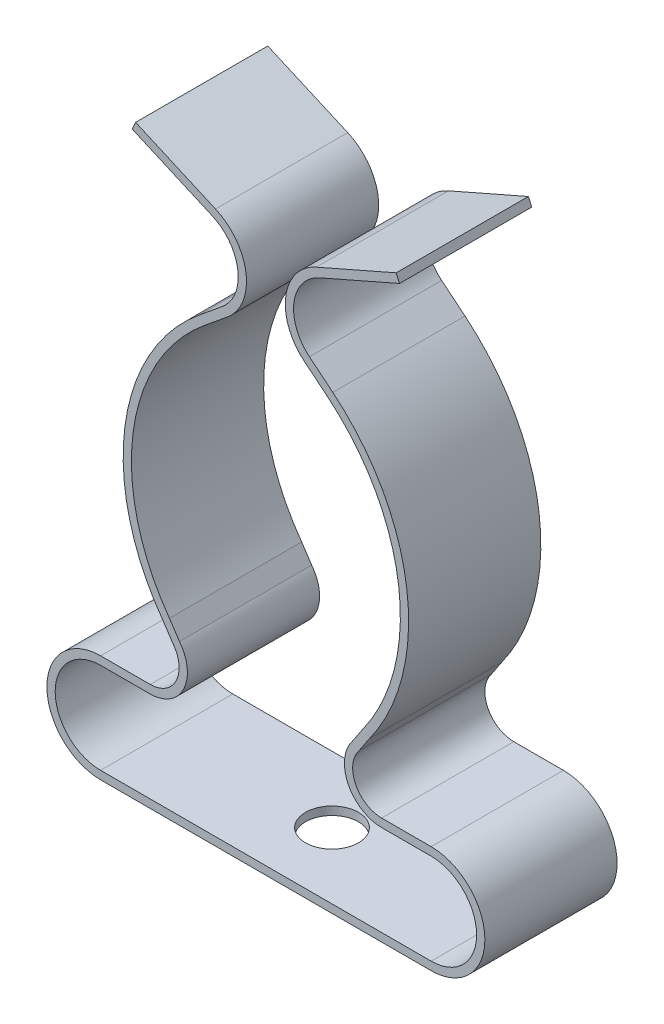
ISO-10303-21;
HEADER;
FILE_DESCRIPTION(('STEP AP214'),'2;1');
FILE_NAME('part.step','',(''),(''),'','','');
FILE_SCHEMA(('AUTOMOTIVE_DESIGN { 1 0 10303 214 1 1 1 1 }'));
ENDSEC;
DATA;
#1=APPLICATION_CONTEXT('core data for automotive mechanical design processes');
#2=APPLICATION_PROTOCOL_DEFINITION('international standard','automotive_design',2000,#1);
#3=PRODUCT_CONTEXT('',#1,'mechanical');
#4=PRODUCT('Part','Part','',(#3));
#5=PRODUCT_RELATED_PRODUCT_CATEGORY('part','',(#4));
#6=PRODUCT_DEFINITION_FORMATION('','',#4);
#7=PRODUCT_DEFINITION_CONTEXT('part definition',#1,'design');
#8=PRODUCT_DEFINITION('design','',#6,#7);
#9=PRODUCT_DEFINITION_SHAPE('','',#8);
#10=(LENGTH_UNIT() NAMED_UNIT(*) SI_UNIT(.MILLI.,.METRE.));
#11=(NAMED_UNIT(*) PLANE_ANGLE_UNIT() SI_UNIT($,.RADIAN.));
#12=(NAMED_UNIT(*) SI_UNIT($,.STERADIAN.) SOLID_ANGLE_UNIT());
#13=UNCERTAINTY_MEASURE_WITH_UNIT(LENGTH_MEASURE(1.E-05),#10,'distance_accuracy_value','');
#14=(GEOMETRIC_REPRESENTATION_CONTEXT(3) GLOBAL_UNCERTAINTY_ASSIGNED_CONTEXT((#13)) GLOBAL_UNIT_ASSIGNED_CONTEXT((#10,
#11,#12)) REPRESENTATION_CONTEXT('',''));
#15=CARTESIAN_POINT('',(0.,0.,0.));
#16=DIRECTION('',(0.,0.,1.));
#17=DIRECTION('',(1.,0.,0.));
#18=AXIS2_PLACEMENT_3D('',#15,#16,#17);
#19=CARTESIAN_POINT('',(3.04654596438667,33.1394522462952,0.));
#20=DIRECTION('',(0.40175104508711,-0.915748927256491,0.));
#21=DIRECTION('',(0.915748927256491,0.40175104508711,0.));
#22=AXIS2_PLACEMENT_3D('',#19,#20,#21);
#23=PLANE('',#22);
#24=DIRECTION('',(0.,0.,1.));
#25=VECTOR('',#24,1.);
#26=CARTESIAN_POINT('',(3.04654596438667,33.1394522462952,0.));
#27=LINE('',#26,#25);
#28=CARTESIAN_POINT('',(3.04654596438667,33.1394522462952,4.));
#29=VERTEX_POINT('',#28);
#30=CARTESIAN_POINT('',(3.04654596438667,33.1394522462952,-4.));
#31=VERTEX_POINT('',#30);
#32=EDGE_CURVE('E554',#29,#31,#27,.F.);
#33=ORIENTED_EDGE('',*,*,#32,.F.);
#34=DIRECTION('',(0.915748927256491,0.40175104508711,0.));
#35=VECTOR('',#34,1.);
#36=CARTESIAN_POINT('',(3.04654596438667,33.1394522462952,4.));
#37=LINE('',#36,#35);
#38=CARTESIAN_POINT('',(7.88499445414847,35.2621429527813,4.));
#39=VERTEX_POINT('',#38);
#40=EDGE_CURVE('E39',#29,#39,#37,.T.);
#41=ORIENTED_EDGE('',*,*,#40,.T.);
#42=DIRECTION('',(0.,0.,1.));
#43=VECTOR('',#42,1.);
#44=CARTESIAN_POINT('',(7.88499445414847,35.2621429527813,0.));
#45=LINE('',#44,#43);
#46=CARTESIAN_POINT('',(7.88499445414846,35.2621429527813,-4.));
#47=VERTEX_POINT('',#46);
#48=EDGE_CURVE('E46',#39,#47,#45,.F.);
#49=ORIENTED_EDGE('',*,*,#48,.T.);
#50=DIRECTION('',(0.915748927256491,0.40175104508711,0.));
#51=VECTOR('',#50,1.);
#52=CARTESIAN_POINT('',(3.04654596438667,33.1394522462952,-4.));
#53=LINE('',#52,#51);
#54=EDGE_CURVE('E12',#31,#47,#53,.T.);
#55=ORIENTED_EDGE('',*,*,#54,.F.);
#56=EDGE_LOOP('',(#33,#41,#49,#55));
#57=FACE_BOUND('',#56,.T.);
#58=ADVANCED_FACE('F32',(#57),#23,.F.);
#59=CARTESIAN_POINT('',(3.2474241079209,32.6815718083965,0.));
#60=DIRECTION('',(-0.40175104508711,0.915748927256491,0.));
#61=DIRECTION('',(-0.915748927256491,-0.40175104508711,0.));
#62=AXIS2_PLACEMENT_3D('',#59,#60,#61);
#63=PLANE('',#62);
#64=DIRECTION('',(0.,0.,1.));
#65=VECTOR('',#64,1.);
#66=CARTESIAN_POINT('',(3.2474241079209,32.6815718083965,0.));
#67=LINE('',#66,#65);
#68=CARTESIAN_POINT('',(3.2474241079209,32.6815718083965,-4.));
#69=VERTEX_POINT('',#68);
#70=CARTESIAN_POINT('',(3.2474241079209,32.6815718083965,4.));
#71=VERTEX_POINT('',#70);
#72=EDGE_CURVE('E551',#69,#71,#67,.T.);
#73=ORIENTED_EDGE('',*,*,#72,.F.);
#74=DIRECTION('',(0.915748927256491,0.40175104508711,0.));
#75=VECTOR('',#74,1.);
#76=CARTESIAN_POINT('',(3.2474241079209,32.6815718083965,-4.));
#77=LINE('',#76,#75);
#78=CARTESIAN_POINT('',(8.0858725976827,34.8042625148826,-4.));
#79=VERTEX_POINT('',#78);
#80=EDGE_CURVE('E575',#69,#79,#77,.T.);
#81=ORIENTED_EDGE('',*,*,#80,.T.);
#82=DIRECTION('',(0.,0.,1.));
#83=VECTOR('',#82,1.);
#84=CARTESIAN_POINT('',(8.0858725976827,34.8042625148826,0.));
#85=LINE('',#84,#83);
#86=CARTESIAN_POINT('',(8.0858725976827,34.8042625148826,4.));
#87=VERTEX_POINT('',#86);
#88=EDGE_CURVE('E571',#79,#87,#85,.T.);
#89=ORIENTED_EDGE('',*,*,#88,.T.);
#90=DIRECTION('',(0.915748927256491,0.40175104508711,0.));
#91=VECTOR('',#90,1.);
#92=CARTESIAN_POINT('',(3.2474241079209,32.6815718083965,4.));
#93=LINE('',#92,#91);
#94=EDGE_CURVE('E578',#71,#87,#93,.T.);
#95=ORIENTED_EDGE('',*,*,#94,.F.);
#96=EDGE_LOOP('',(#73,#81,#89,#95));
#97=FACE_BOUND('',#96,.T.);
#98=ADVANCED_FACE('F682',(#97),#63,.F.);
#99=CARTESIAN_POINT('',(4.30455731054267,30.2719487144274,0.));
#100=DIRECTION('',(0.,0.,-1.));
#101=DIRECTION('',(-1.,0.,0.));
#102=AXIS2_PLACEMENT_3D('',#99,#100,#101);
#103=CYLINDRICAL_SURFACE('',#102,3.13132065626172);
#104=DIRECTION('',(0.,0.,1.));
#105=VECTOR('',#104,1.);
#106=CARTESIAN_POINT('',(2.31828715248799,27.8512257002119,0.));
#107=LINE('',#106,#105);
#108=CARTESIAN_POINT('',(2.31828715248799,27.8512257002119,4.));
#109=VERTEX_POINT('',#108);
#110=CARTESIAN_POINT('',(2.31828715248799,27.8512257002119,-4.));
#111=VERTEX_POINT('',#110);
#112=EDGE_CURVE('E536',#109,#111,#107,.F.);
#113=ORIENTED_EDGE('',*,*,#112,.F.);
#114=CARTESIAN_POINT('',(4.30455731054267,30.2719487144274,4.));
#115=DIRECTION('',(0.,0.,-1.));
#116=DIRECTION('',(-1.,0.,0.));
#117=AXIS2_PLACEMENT_3D('',#114,#115,#116);
#118=CIRCLE('',#117,3.13132065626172);
#119=EDGE_CURVE('E563',#109,#29,#118,.T.);
#120=ORIENTED_EDGE('',*,*,#119,.T.);
#121=ORIENTED_EDGE('',*,*,#32,.T.);
#122=CARTESIAN_POINT('',(4.30455731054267,30.2719487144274,-4.));
#123=DIRECTION('',(0.,0.,-1.));
#124=DIRECTION('',(-1.,0.,0.));
#125=AXIS2_PLACEMENT_3D('',#122,#123,#124);
#126=CIRCLE('',#125,3.13132065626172);
#127=EDGE_CURVE('E566',#111,#31,#126,.T.);
#128=ORIENTED_EDGE('',*,*,#127,.F.);
#129=EDGE_LOOP('',(#113,#120,#121,#128));
#130=FACE_BOUND('',#129,.T.);
#131=ADVANCED_FACE('F583',(#130),#103,.T.);
#132=CARTESIAN_POINT('',(4.30455731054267,30.2719487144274,0.));
#133=DIRECTION('',(0.,0.,-1.));
#134=DIRECTION('',(-1.,0.,0.));
#135=AXIS2_PLACEMENT_3D('',#132,#133,#134);
#136=CYLINDRICAL_SURFACE('',#135,2.6313141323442);
#137=DIRECTION('',(0.,0.,1.));
#138=VECTOR('',#137,1.);
#139=CARTESIAN_POINT('',(2.63545302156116,28.2377646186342,0.));
#140=LINE('',#139,#138);
#141=CARTESIAN_POINT('',(2.63545302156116,28.2377646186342,-4.));
#142=VERTEX_POINT('',#141);
#143=CARTESIAN_POINT('',(2.63545302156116,28.2377646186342,4.));
#144=VERTEX_POINT('',#143);
#145=EDGE_CURVE('E440',#142,#144,#140,.T.);
#146=ORIENTED_EDGE('',*,*,#145,.F.);
#147=CARTESIAN_POINT('',(4.30455731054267,30.2719487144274,-4.));
#148=DIRECTION('',(0.,0.,-1.));
#149=DIRECTION('',(-1.,0.,0.));
#150=AXIS2_PLACEMENT_3D('',#147,#148,#149);
#151=CIRCLE('',#150,2.6313141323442);
#152=EDGE_CURVE('E557',#142,#69,#151,.T.);
#153=ORIENTED_EDGE('',*,*,#152,.T.);
#154=ORIENTED_EDGE('',*,*,#72,.T.);
#155=CARTESIAN_POINT('',(4.30455731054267,30.2719487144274,4.));
#156=DIRECTION('',(0.,0.,-1.));
#157=DIRECTION('',(-1.,0.,0.));
#158=AXIS2_PLACEMENT_3D('',#155,#156,#157);
#159=CIRCLE('',#158,2.6313141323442);
#160=EDGE_CURVE('E560',#144,#71,#159,.T.);
#161=ORIENTED_EDGE('',*,*,#160,.F.);
#162=EDGE_LOOP('',(#146,#153,#154,#161));
#163=FACE_BOUND('',#162,.T.);
#164=ADVANCED_FACE('F679',(#163),#136,.F.);
#165=CARTESIAN_POINT('',(3.73135583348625,26.6917637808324,0.));
#166=DIRECTION('',(0.634323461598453,0.773067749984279,0.));
#167=DIRECTION('',(-0.773067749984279,0.634323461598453,0.));
#168=AXIS2_PLACEMENT_3D('',#165,#166,#167);
#169=PLANE('',#168);
#170=DIRECTION('',(0.,0.,1.));
#171=VECTOR('',#170,1.);
#172=CARTESIAN_POINT('',(3.73135583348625,26.6917637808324,0.));
#173=LINE('',#172,#171);
#174=CARTESIAN_POINT('',(3.73135583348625,26.6917637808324,4.));
#175=VERTEX_POINT('',#174);
#176=CARTESIAN_POINT('',(3.73135583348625,26.6917637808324,-4.));
#177=VERTEX_POINT('',#176);
#178=EDGE_CURVE('E437',#175,#177,#173,.F.);
#179=ORIENTED_EDGE('',*,*,#178,.F.);
#180=DIRECTION('',(-0.773067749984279,0.634323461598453,0.));
#181=VECTOR('',#180,1.);
#182=CARTESIAN_POINT('',(3.73135583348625,26.6917637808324,4.));
#183=LINE('',#182,#181);
#184=EDGE_CURVE('E545',#175,#109,#183,.T.);
#185=ORIENTED_EDGE('',*,*,#184,.T.);
#186=ORIENTED_EDGE('',*,*,#112,.T.);
#187=DIRECTION('',(-0.773067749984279,0.634323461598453,0.));
#188=VECTOR('',#187,1.);
#189=CARTESIAN_POINT('',(3.73135583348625,26.6917637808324,-4.));
#190=LINE('',#189,#188);
#191=EDGE_CURVE('E548',#177,#111,#190,.T.);
#192=ORIENTED_EDGE('',*,*,#191,.F.);
#193=EDGE_LOOP('',(#179,#185,#186,#192));
#194=FACE_BOUND('',#193,.T.);
#195=ADVANCED_FACE('F585',(#194),#169,.F.);
#196=CARTESIAN_POINT('',(4.04852170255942,27.0783026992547,0.));
#197=DIRECTION('',(-0.634323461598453,-0.773067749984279,0.));
#198=DIRECTION('',(0.773067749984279,-0.634323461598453,0.));
#199=AXIS2_PLACEMENT_3D('',#196,#197,#198);
#200=PLANE('',#199);
#201=DIRECTION('',(0.,0.,1.));
#202=VECTOR('',#201,1.);
#203=CARTESIAN_POINT('',(4.04852170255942,27.0783026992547,0.));
#204=LINE('',#203,#202);
#205=CARTESIAN_POINT('',(4.04852170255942,27.0783026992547,-4.));
#206=VERTEX_POINT('',#205);
#207=CARTESIAN_POINT('',(4.04852170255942,27.0783026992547,4.));
#208=VERTEX_POINT('',#207);
#209=EDGE_CURVE('E441',#206,#208,#204,.T.);
#210=ORIENTED_EDGE('',*,*,#209,.F.);
#211=DIRECTION('',(-0.773067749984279,0.634323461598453,0.));
#212=VECTOR('',#211,1.);
#213=CARTESIAN_POINT('',(4.04852170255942,27.0783026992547,-4.));
#214=LINE('',#213,#212);
#215=EDGE_CURVE('E539',#206,#142,#214,.T.);
#216=ORIENTED_EDGE('',*,*,#215,.T.);
#217=ORIENTED_EDGE('',*,*,#145,.T.);
#218=DIRECTION('',(-0.773067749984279,0.634323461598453,0.));
#219=VECTOR('',#218,1.);
#220=CARTESIAN_POINT('',(4.04852170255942,27.0783026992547,4.));
#221=LINE('',#220,#219);
#222=EDGE_CURVE('E542',#208,#144,#221,.T.);
#223=ORIENTED_EDGE('',*,*,#222,.F.);
#224=EDGE_LOOP('',(#210,#216,#217,#223));
#225=FACE_BOUND('',#224,.T.);
#226=ADVANCED_FACE('F676',(#225),#200,.F.);
#227=CARTESIAN_POINT('',(-3.90918494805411,17.3800229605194,0.));
#228=DIRECTION('',(0.,0.,1.));
#229=DIRECTION('',(1.,0.,0.));
#230=AXIS2_PLACEMENT_3D('',#227,#228,#229);
#231=CYLINDRICAL_SURFACE('',#230,12.5451873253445);
#232=CARTESIAN_POINT('',(-3.90918494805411,17.3800229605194,-4.));
#233=DIRECTION('',(0.,0.,1.));
#234=DIRECTION('',(1.,0.,0.));
#235=AXIS2_PLACEMENT_3D('',#232,#233,#234);
#236=CIRCLE('',#235,12.5451873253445);
#237=CARTESIAN_POINT('',(6.24624829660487,10.0146376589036,-4.));
#238=VERTEX_POINT('',#237);
#239=EDGE_CURVE('E444',#238,#206,#236,.T.);
#240=ORIENTED_EDGE('',*,*,#239,.T.);
#241=ORIENTED_EDGE('',*,*,#209,.T.);
#242=CARTESIAN_POINT('',(-3.90918494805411,17.3800229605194,4.));
#243=DIRECTION('',(0.,0.,1.));
#244=DIRECTION('',(1.,0.,0.));
#245=AXIS2_PLACEMENT_3D('',#242,#243,#244);
#246=CIRCLE('',#245,12.5451873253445);
#247=CARTESIAN_POINT('',(6.24624829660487,10.0146376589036,4.));
#248=VERTEX_POINT('',#247);
#249=EDGE_CURVE('E452',#248,#208,#246,.T.);
#250=ORIENTED_EDGE('',*,*,#249,.F.);
#251=DIRECTION('',(0.,0.,-1.));
#252=VECTOR('',#251,1.);
#253=CARTESIAN_POINT('',(6.24624829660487,10.0146376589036,0.));
#254=LINE('',#253,#252);
#255=EDGE_CURVE('E448',#248,#238,#254,.T.);
#256=ORIENTED_EDGE('',*,*,#255,.T.);
#257=EDGE_LOOP('',(#240,#241,#250,#256));
#258=FACE_BOUND('',#257,.T.);
#259=ADVANCED_FACE('F673',(#258),#231,.T.);
#260=CARTESIAN_POINT('',(-3.90918494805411,17.3800229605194,0.));
#261=DIRECTION('',(0.,0.,1.));
#262=DIRECTION('',(1.,0.,0.));
#263=AXIS2_PLACEMENT_3D('',#260,#261,#262);
#264=CYLINDRICAL_SURFACE('',#263,12.0451808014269);
#265=CARTESIAN_POINT('',(-3.90918494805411,17.3800229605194,4.));
#266=DIRECTION('',(0.,0.,1.));
#267=DIRECTION('',(1.,0.,0.));
#268=AXIS2_PLACEMENT_3D('',#265,#266,#267);
#269=CIRCLE('',#268,12.0451808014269);
#270=CARTESIAN_POINT('',(5.83559751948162,10.300079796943,4.));
#271=VERTEX_POINT('',#270);
#272=EDGE_CURVE('E526',#271,#175,#269,.T.);
#273=ORIENTED_EDGE('',*,*,#272,.T.);
#274=ORIENTED_EDGE('',*,*,#178,.T.);
#275=CARTESIAN_POINT('',(-3.90918494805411,17.3800229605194,-4.));
#276=DIRECTION('',(0.,0.,1.));
#277=DIRECTION('',(1.,0.,0.));
#278=AXIS2_PLACEMENT_3D('',#275,#276,#277);
#279=CIRCLE('',#278,12.0451808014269);
#280=CARTESIAN_POINT('',(5.83559751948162,10.300079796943,-4.));
#281=VERTEX_POINT('',#280);
#282=EDGE_CURVE('E529',#281,#177,#279,.T.);
#283=ORIENTED_EDGE('',*,*,#282,.F.);
#284=DIRECTION('',(0.,0.,1.));
#285=VECTOR('',#284,1.);
#286=CARTESIAN_POINT('',(5.83559751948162,10.300079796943,0.));
#287=LINE('',#286,#285);
#288=EDGE_CURVE('E445',#281,#271,#287,.T.);
#289=ORIENTED_EDGE('',*,*,#288,.T.);
#290=EDGE_LOOP('',(#273,#274,#283,#289));
#291=FACE_BOUND('',#290,.T.);
#292=ADVANCED_FACE('F587',(#291),#264,.F.);
#293=CARTESIAN_POINT('',(5.63268850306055,9.09222674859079,0.));
#294=DIRECTION('',(-0.832625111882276,0.553837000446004,0.));
#295=DIRECTION('',(-0.553837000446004,-0.832625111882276,0.));
#296=AXIS2_PLACEMENT_3D('',#293,#294,#295);
#297=PLANE('',#296);
#298=ORIENTED_EDGE('',*,*,#255,.F.);
#299=DIRECTION('',(0.553837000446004,0.832625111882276,0.));
#300=VECTOR('',#299,1.);
#301=CARTESIAN_POINT('',(5.63268850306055,9.09222674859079,4.));
#302=LINE('',#301,#300);
#303=CARTESIAN_POINT('',(5.63268850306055,9.09222674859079,4.));
#304=VERTEX_POINT('',#303);
#305=EDGE_CURVE('E456',#304,#248,#302,.T.);
#306=ORIENTED_EDGE('',*,*,#305,.F.);
#307=DIRECTION('',(0.,0.,-1.));
#308=VECTOR('',#307,1.);
#309=CARTESIAN_POINT('',(5.63268850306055,9.09222674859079,0.));
#310=LINE('',#309,#308);
#311=CARTESIAN_POINT('',(5.63268850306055,9.09222674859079,-4.));
#312=VERTEX_POINT('',#311);
#313=EDGE_CURVE('E457',#312,#304,#310,.F.);
#314=ORIENTED_EDGE('',*,*,#313,.F.);
#315=DIRECTION('',(0.553837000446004,0.832625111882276,0.));
#316=VECTOR('',#315,1.);
#317=CARTESIAN_POINT('',(5.63268850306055,9.09222674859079,-4.));
#318=LINE('',#317,#316);
#319=EDGE_CURVE('E449',#312,#238,#318,.T.);
#320=ORIENTED_EDGE('',*,*,#319,.T.);
#321=EDGE_LOOP('',(#298,#306,#314,#320));
#322=FACE_BOUND('',#321,.T.);
#323=ADVANCED_FACE('F671',(#322),#297,.F.);
#324=CARTESIAN_POINT('',(5.22762585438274,9.38606994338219,0.));
#325=DIRECTION('',(0.832625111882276,-0.553837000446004,0.));
#326=DIRECTION('',(0.553837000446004,0.832625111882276,0.));
#327=AXIS2_PLACEMENT_3D('',#324,#325,#326);
#328=PLANE('',#327);
#329=ORIENTED_EDGE('',*,*,#288,.F.);
#330=DIRECTION('',(0.553837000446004,0.832625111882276,0.));
#331=VECTOR('',#330,1.);
#332=CARTESIAN_POINT('',(5.22762585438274,9.38606994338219,-4.));
#333=LINE('',#332,#331);
#334=CARTESIAN_POINT('',(5.22762585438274,9.38606994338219,-4.));
#335=VERTEX_POINT('',#334);
#336=EDGE_CURVE('E519',#335,#281,#333,.T.);
#337=ORIENTED_EDGE('',*,*,#336,.F.);
#338=DIRECTION('',(0.,0.,-1.));
#339=VECTOR('',#338,1.);
#340=CARTESIAN_POINT('',(5.22762585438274,9.38606994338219,0.));
#341=LINE('',#340,#339);
#342=CARTESIAN_POINT('',(5.22762585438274,9.38606994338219,4.));
#343=VERTEX_POINT('',#342);
#344=EDGE_CURVE('E453',#343,#335,#341,.T.);
#345=ORIENTED_EDGE('',*,*,#344,.F.);
#346=DIRECTION('',(0.553837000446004,0.832625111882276,0.));
#347=VECTOR('',#346,1.);
#348=CARTESIAN_POINT('',(5.22762585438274,9.38606994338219,4.));
#349=LINE('',#348,#347);
#350=EDGE_CURVE('E516',#343,#271,#349,.T.);
#351=ORIENTED_EDGE('',*,*,#350,.T.);
#352=EDGE_LOOP('',(#329,#337,#345,#351));
#353=FACE_BOUND('',#352,.T.);
#354=ADVANCED_FACE('F591',(#353),#328,.F.);
#355=CARTESIAN_POINT('',(7.,8.,0.));
#356=DIRECTION('',(0.,0.,-1.));
#357=DIRECTION('',(-1.,0.,0.));
#358=AXIS2_PLACEMENT_3D('',#355,#356,#357);
#359=CYLINDRICAL_SURFACE('',#358,2.25);
#360=CARTESIAN_POINT('',(7.,8.,4.));
#361=DIRECTION('',(0.,0.,-1.));
#362=DIRECTION('',(-1.,0.,0.));
#363=AXIS2_PLACEMENT_3D('',#360,#361,#362);
#364=CIRCLE('',#363,2.25);
#365=CARTESIAN_POINT('',(7.,5.75,4.));
#366=VERTEX_POINT('',#365);
#367=EDGE_CURVE('E500',#366,#343,#364,.T.);
#368=ORIENTED_EDGE('',*,*,#367,.T.);
#369=ORIENTED_EDGE('',*,*,#344,.T.);
#370=CARTESIAN_POINT('',(7.,8.,-4.));
#371=DIRECTION('',(0.,0.,-1.));
#372=DIRECTION('',(-1.,0.,0.));
#373=AXIS2_PLACEMENT_3D('',#370,#371,#372);
#374=CIRCLE('',#373,2.25);
#375=CARTESIAN_POINT('',(7.,5.75,-4.));
#376=VERTEX_POINT('',#375);
#377=EDGE_CURVE('E503',#376,#335,#374,.T.);
#378=ORIENTED_EDGE('',*,*,#377,.F.);
#379=DIRECTION('',(0.,0.,1.));
#380=VECTOR('',#379,1.);
#381=CARTESIAN_POINT('',(7.,5.75,4.));
#382=LINE('',#381,#380);
#383=EDGE_CURVE('E482',#376,#366,#382,.T.);
#384=ORIENTED_EDGE('',*,*,#383,.T.);
#385=EDGE_LOOP('',(#368,#369,#378,#384));
#386=FACE_BOUND('',#385,.T.);
#387=ADVANCED_FACE('F593',(#386),#359,.T.);
#388=CARTESIAN_POINT('',(7.,8.,0.));
#389=DIRECTION('',(0.,0.,-1.));
#390=DIRECTION('',(-1.,0.,0.));
#391=AXIS2_PLACEMENT_3D('',#388,#389,#390);
#392=CYLINDRICAL_SURFACE('',#391,1.75);
#393=CARTESIAN_POINT('',(7.,8.,-4.));
#394=DIRECTION('',(0.,0.,-1.));
#395=DIRECTION('',(-1.,0.,0.));
#396=AXIS2_PLACEMENT_3D('',#393,#394,#395);
#397=CIRCLE('',#396,1.75);
#398=CARTESIAN_POINT('',(7.,6.25,-4.));
#399=VERTEX_POINT('',#398);
#400=EDGE_CURVE('E506',#399,#312,#397,.T.);
#401=ORIENTED_EDGE('',*,*,#400,.T.);
#402=ORIENTED_EDGE('',*,*,#313,.T.);
#403=CARTESIAN_POINT('',(7.,8.,4.));
#404=DIRECTION('',(0.,0.,-1.));
#405=DIRECTION('',(-1.,0.,0.));
#406=AXIS2_PLACEMENT_3D('',#403,#404,#405);
#407=CIRCLE('',#406,1.75);
#408=CARTESIAN_POINT('',(7.,6.25,4.));
#409=VERTEX_POINT('',#408);
#410=EDGE_CURVE('E509',#409,#304,#407,.T.);
#411=ORIENTED_EDGE('',*,*,#410,.F.);
#412=DIRECTION('',(0.,0.,-1.));
#413=VECTOR('',#412,1.);
#414=CARTESIAN_POINT('',(7.,6.25,4.));
#415=LINE('',#414,#413);
#416=EDGE_CURVE('E485',#409,#399,#415,.T.);
#417=ORIENTED_EDGE('',*,*,#416,.T.);
#418=EDGE_LOOP('',(#401,#402,#411,#417));
#419=FACE_BOUND('',#418,.T.);
#420=ADVANCED_FACE('F668',(#419),#392,.F.);
#421=CARTESIAN_POINT('',(10.,6.25,4.));
#422=DIRECTION('',(0.,1.,0.));
#423=DIRECTION('',(-1.,0.,0.));
#424=AXIS2_PLACEMENT_3D('',#421,#422,#423);
#425=PLANE('',#424);
#426=DIRECTION('',(0.,0.,-1.));
#427=VECTOR('',#426,1.);
#428=CARTESIAN_POINT('',(10.,6.25,4.));
#429=LINE('',#428,#427);
#430=CARTESIAN_POINT('',(10.,6.25,4.));
#431=VERTEX_POINT('',#430);
#432=CARTESIAN_POINT('',(10.,6.25,-4.));
#433=VERTEX_POINT('',#432);
#434=EDGE_CURVE('E469',#431,#433,#429,.T.);
#435=ORIENTED_EDGE('',*,*,#434,.T.);
#436=DIRECTION('',(-1.,0.,0.));
#437=VECTOR('',#436,1.);
#438=CARTESIAN_POINT('',(10.,6.25,-4.));
#439=LINE('',#438,#437);
#440=EDGE_CURVE('E494',#433,#399,#439,.T.);
#441=ORIENTED_EDGE('',*,*,#440,.T.);
#442=ORIENTED_EDGE('',*,*,#416,.F.);
#443=DIRECTION('',(-1.,0.,0.));
#444=VECTOR('',#443,1.);
#445=CARTESIAN_POINT('',(10.,6.25,4.));
#446=LINE('',#445,#444);
#447=EDGE_CURVE('E497',#431,#409,#446,.T.);
#448=ORIENTED_EDGE('',*,*,#447,.F.);
#449=EDGE_LOOP('',(#435,#441,#442,#448));
#450=FACE_BOUND('',#449,.T.);
#451=ADVANCED_FACE('F664',(#450),#425,.T.);
#452=CARTESIAN_POINT('',(10.,5.75,4.));
#453=DIRECTION('',(0.,-1.,0.));
#454=DIRECTION('',(1.,0.,0.));
#455=AXIS2_PLACEMENT_3D('',#452,#453,#454);
#456=PLANE('',#455);
#457=DIRECTION('',(0.,0.,1.));
#458=VECTOR('',#457,1.);
#459=CARTESIAN_POINT('',(10.,5.75,4.));
#460=LINE('',#459,#458);
#461=CARTESIAN_POINT('',(10.,5.75,-4.));
#462=VERTEX_POINT('',#461);
#463=CARTESIAN_POINT('',(10.,5.75,4.));
#464=VERTEX_POINT('',#463);
#465=EDGE_CURVE('E466',#462,#464,#460,.T.);
#466=ORIENTED_EDGE('',*,*,#465,.T.);
#467=DIRECTION('',(-1.,0.,0.));
#468=VECTOR('',#467,1.);
#469=CARTESIAN_POINT('',(10.,5.75,4.));
#470=LINE('',#469,#468);
#471=EDGE_CURVE('E488',#464,#366,#470,.T.);
#472=ORIENTED_EDGE('',*,*,#471,.T.);
#473=ORIENTED_EDGE('',*,*,#383,.F.);
#474=DIRECTION('',(-1.,0.,0.));
#475=VECTOR('',#474,1.);
#476=CARTESIAN_POINT('',(10.,5.75,-4.));
#477=LINE('',#476,#475);
#478=EDGE_CURVE('E491',#462,#376,#477,.T.);
#479=ORIENTED_EDGE('',*,*,#478,.F.);
#480=EDGE_LOOP('',(#466,#472,#473,#479));
#481=FACE_BOUND('',#480,.T.);
#482=ADVANCED_FACE('F596',(#481),#456,.T.);
#483=CARTESIAN_POINT('',(10.,3.,0.));
#484=DIRECTION('',(0.,0.,1.));
#485=DIRECTION('',(1.,0.,0.));
#486=AXIS2_PLACEMENT_3D('',#483,#484,#485);
#487=CYLINDRICAL_SURFACE('',#486,3.25);
#488=DIRECTION('',(0.,0.,-1.));
#489=VECTOR('',#488,1.);
#490=CARTESIAN_POINT('',(10.,-0.250000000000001,4.));
#491=LINE('',#490,#489);
#492=CARTESIAN_POINT('',(10.,-0.250000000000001,4.));
#493=VERTEX_POINT('',#492);
#494=CARTESIAN_POINT('',(10.,-0.250000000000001,-4.));
#495=VERTEX_POINT('',#494);
#496=EDGE_CURVE('E436',#493,#495,#491,.T.);
#497=ORIENTED_EDGE('',*,*,#496,.T.);
#498=CARTESIAN_POINT('',(10.,3.,-4.));
#499=DIRECTION('',(0.,0.,1.));
#500=DIRECTION('',(1.,0.,0.));
#501=AXIS2_PLACEMENT_3D('',#498,#499,#500);
#502=CIRCLE('',#501,3.25);
#503=EDGE_CURVE('E476',#495,#433,#502,.T.);
#504=ORIENTED_EDGE('',*,*,#503,.T.);
#505=ORIENTED_EDGE('',*,*,#434,.F.);
#506=CARTESIAN_POINT('',(10.,3.,4.));
#507=DIRECTION('',(0.,0.,1.));
#508=DIRECTION('',(1.,0.,0.));
#509=AXIS2_PLACEMENT_3D('',#506,#507,#508);
#510=CIRCLE('',#509,3.25);
#511=EDGE_CURVE('E479',#493,#431,#510,.T.);
#512=ORIENTED_EDGE('',*,*,#511,.F.);
#513=EDGE_LOOP('',(#497,#504,#505,#512));
#514=FACE_BOUND('',#513,.T.);
#515=ADVANCED_FACE('F661',(#514),#487,.T.);
#516=CARTESIAN_POINT('',(10.,3.,0.));
#517=DIRECTION('',(0.,0.,1.));
#518=DIRECTION('',(1.,0.,0.));
#519=AXIS2_PLACEMENT_3D('',#516,#517,#518);
#520=CYLINDRICAL_SURFACE('',#519,2.75);
#521=DIRECTION('',(0.,0.,1.));
#522=VECTOR('',#521,1.);
#523=CARTESIAN_POINT('',(10.,0.249999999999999,4.));
#524=LINE('',#523,#522);
#525=CARTESIAN_POINT('',(10.,0.249999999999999,-4.));
#526=VERTEX_POINT('',#525);
#527=CARTESIAN_POINT('',(10.,0.249999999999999,4.));
#528=VERTEX_POINT('',#527);
#529=EDGE_CURVE('E276',#526,#528,#524,.T.);
#530=ORIENTED_EDGE('',*,*,#529,.T.);
#531=CARTESIAN_POINT('',(10.,3.,4.));
#532=DIRECTION('',(0.,0.,1.));
#533=DIRECTION('',(1.,0.,0.));
#534=AXIS2_PLACEMENT_3D('',#531,#532,#533);
#535=CIRCLE('',#534,2.75);
#536=EDGE_CURVE('E270',#528,#464,#535,.T.);
#537=ORIENTED_EDGE('',*,*,#536,.T.);
#538=ORIENTED_EDGE('',*,*,#465,.F.);
#539=CARTESIAN_POINT('',(10.,3.,-4.));
#540=DIRECTION('',(0.,0.,1.));
#541=DIRECTION('',(1.,0.,0.));
#542=AXIS2_PLACEMENT_3D('',#539,#540,#541);
#543=CIRCLE('',#542,2.75);
#544=EDGE_CURVE('E473',#526,#462,#543,.T.);
#545=ORIENTED_EDGE('',*,*,#544,.F.);
#546=EDGE_LOOP('',(#530,#537,#538,#545));
#547=FACE_BOUND('',#546,.T.);
#548=ADVANCED_FACE('F599',(#547),#520,.F.);
#549=CARTESIAN_POINT('',(10.,0.249999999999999,4.));
#550=DIRECTION('',(0.,0.,-1.));
#551=DIRECTION('',(-1.,0.,0.));
#552=AXIS2_PLACEMENT_3D('',#549,#550,#551);
#553=PLANE('',#552);
#554=DIRECTION('',(-1.,0.,0.));
#555=VECTOR('',#554,1.);
#556=CARTESIAN_POINT('',(10.,0.249999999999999,4.));
#557=LINE('',#556,#555);
#558=CARTESIAN_POINT('',(-10.,0.249999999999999,4.));
#559=VERTEX_POINT('',#558);
#560=EDGE_CURVE('E264',#528,#559,#557,.T.);
#561=ORIENTED_EDGE('',*,*,#560,.T.);
#562=CARTESIAN_POINT('',(-10.,3.,4.));
#563=DIRECTION('',(0.,0.,-1.));
#564=DIRECTION('',(-1.,0.,0.));
#565=AXIS2_PLACEMENT_3D('',#562,#563,#564);
#566=CIRCLE('',#565,2.75);
#567=CARTESIAN_POINT('',(-10.,5.75,4.));
#568=VERTEX_POINT('',#567);
#569=EDGE_CURVE('E268',#559,#568,#566,.T.);
#570=ORIENTED_EDGE('',*,*,#569,.T.);
#571=DIRECTION('',(1.,0.,0.));
#572=VECTOR('',#571,1.);
#573=CARTESIAN_POINT('',(-10.,5.75,4.));
#574=LINE('',#573,#572);
#575=CARTESIAN_POINT('',(-7.,5.75,4.));
#576=VERTEX_POINT('',#575);
#577=EDGE_CURVE('E329',#568,#576,#574,.T.);
#578=ORIENTED_EDGE('',*,*,#577,.T.);
#579=CARTESIAN_POINT('',(-7.,8.,4.));
#580=DIRECTION('',(0.,0.,1.));
#581=DIRECTION('',(1.,0.,0.));
#582=AXIS2_PLACEMENT_3D('',#579,#580,#581);
#583=CIRCLE('',#582,2.25);
#584=CARTESIAN_POINT('',(-5.22762585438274,9.38606994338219,4.));
#585=VERTEX_POINT('',#584);
#586=EDGE_CURVE('E340',#576,#585,#583,.T.);
#587=ORIENTED_EDGE('',*,*,#586,.T.);
#588=DIRECTION('',(-0.553837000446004,0.832625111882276,0.));
#589=VECTOR('',#588,1.);
#590=CARTESIAN_POINT('',(-5.22762585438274,9.38606994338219,4.));
#591=LINE('',#590,#589);
#592=CARTESIAN_POINT('',(-5.83559751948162,10.300079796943,4.));
#593=VERTEX_POINT('',#592);
#594=EDGE_CURVE('E355',#585,#593,#591,.T.);
#595=ORIENTED_EDGE('',*,*,#594,.T.);
#596=CARTESIAN_POINT('',(3.90918494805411,17.3800229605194,4.));
#597=DIRECTION('',(0.,0.,-1.));
#598=DIRECTION('',(-1.,0.,0.));
#599=AXIS2_PLACEMENT_3D('',#596,#597,#598);
#600=CIRCLE('',#599,12.0451808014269);
#601=CARTESIAN_POINT('',(-3.73135583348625,26.6917637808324,4.));
#602=VERTEX_POINT('',#601);
#603=EDGE_CURVE('E362',#593,#602,#600,.T.);
#604=ORIENTED_EDGE('',*,*,#603,.T.);
#605=DIRECTION('',(0.773067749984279,0.634323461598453,0.));
#606=VECTOR('',#605,1.);
#607=CARTESIAN_POINT('',(-3.73135583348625,26.6917637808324,4.));
#608=LINE('',#607,#606);
#609=CARTESIAN_POINT('',(-2.318287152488,27.8512257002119,4.));
#610=VERTEX_POINT('',#609);
#611=EDGE_CURVE('E382',#602,#610,#608,.T.);
#612=ORIENTED_EDGE('',*,*,#611,.T.);
#613=CARTESIAN_POINT('',(-4.30455731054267,30.2719487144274,4.));
#614=DIRECTION('',(0.,0.,1.));
#615=DIRECTION('',(1.,0.,0.));
#616=AXIS2_PLACEMENT_3D('',#613,#614,#615);
#617=CIRCLE('',#616,3.13132065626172);
#618=CARTESIAN_POINT('',(-3.04654596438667,33.1394522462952,4.));
#619=VERTEX_POINT('',#618);
#620=EDGE_CURVE('E400',#610,#619,#617,.T.);
#621=ORIENTED_EDGE('',*,*,#620,.T.);
#622=DIRECTION('',(-0.915748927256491,0.40175104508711,0.));
#623=VECTOR('',#622,1.);
#624=CARTESIAN_POINT('',(-3.04654596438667,33.1394522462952,4.));
#625=LINE('',#624,#623);
#626=CARTESIAN_POINT('',(-7.88499445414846,35.2621429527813,4.));
#627=VERTEX_POINT('',#626);
#628=EDGE_CURVE('E424',#619,#627,#625,.T.);
#629=ORIENTED_EDGE('',*,*,#628,.T.);
#630=DIRECTION('',(0.40175104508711,0.915748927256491,0.));
#631=VECTOR('',#630,1.);
#632=CARTESIAN_POINT('',(-3.44518038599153,45.382228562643,4.));
#633=LINE('',#632,#631);
#634=CARTESIAN_POINT('',(-8.0858725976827,34.8042625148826,4.));
#635=VERTEX_POINT('',#634);
#636=EDGE_CURVE('E415',#635,#627,#633,.T.);
#637=ORIENTED_EDGE('',*,*,#636,.F.);
#638=DIRECTION('',(-0.915748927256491,0.40175104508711,0.));
#639=VECTOR('',#638,1.);
#640=CARTESIAN_POINT('',(-3.2474241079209,32.6815718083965,4.));
#641=LINE('',#640,#639);
#642=CARTESIAN_POINT('',(-3.2474241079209,32.6815718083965,4.));
#643=VERTEX_POINT('',#642);
#644=EDGE_CURVE('E427',#643,#635,#641,.T.);
#645=ORIENTED_EDGE('',*,*,#644,.F.);
#646=CARTESIAN_POINT('',(-4.30455731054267,30.2719487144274,4.));
#647=DIRECTION('',(0.,0.,1.));
#648=DIRECTION('',(1.,0.,0.));
#649=AXIS2_PLACEMENT_3D('',#646,#647,#648);
#650=CIRCLE('',#649,2.6313141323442);
#651=CARTESIAN_POINT('',(-2.63545302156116,28.2377646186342,4.));
#652=VERTEX_POINT('',#651);
#653=EDGE_CURVE('E403',#652,#643,#650,.T.);
#654=ORIENTED_EDGE('',*,*,#653,.F.);
#655=DIRECTION('',(0.773067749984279,0.634323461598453,0.));
#656=VECTOR('',#655,1.);
#657=CARTESIAN_POINT('',(-4.04852170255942,27.0783026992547,4.));
#658=LINE('',#657,#656);
#659=CARTESIAN_POINT('',(-4.04852170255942,27.0783026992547,4.));
#660=VERTEX_POINT('',#659);
#661=EDGE_CURVE('E385',#660,#652,#658,.T.);
#662=ORIENTED_EDGE('',*,*,#661,.F.);
#663=CARTESIAN_POINT('',(3.90918494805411,17.3800229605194,4.));
#664=DIRECTION('',(0.,0.,-1.));
#665=DIRECTION('',(-1.,0.,0.));
#666=AXIS2_PLACEMENT_3D('',#663,#664,#665);
#667=CIRCLE('',#666,12.5451873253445);
#668=CARTESIAN_POINT('',(-6.24624829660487,10.0146376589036,4.));
#669=VERTEX_POINT('',#668);
#670=EDGE_CURVE('E365',#669,#660,#667,.T.);
#671=ORIENTED_EDGE('',*,*,#670,.F.);
#672=DIRECTION('',(-0.553837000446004,0.832625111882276,0.));
#673=VECTOR('',#672,1.);
#674=CARTESIAN_POINT('',(-5.63268850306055,9.09222674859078,4.));
#675=LINE('',#674,#673);
#676=CARTESIAN_POINT('',(-5.63268850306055,9.09222674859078,4.));
#677=VERTEX_POINT('',#676);
#678=EDGE_CURVE('E346',#677,#669,#675,.T.);
#679=ORIENTED_EDGE('',*,*,#678,.F.);
#680=CARTESIAN_POINT('',(-7.,8.,4.));
#681=DIRECTION('',(0.,0.,1.));
#682=DIRECTION('',(1.,0.,0.));
#683=AXIS2_PLACEMENT_3D('',#680,#681,#682);
#684=CIRCLE('',#683,1.75);
#685=CARTESIAN_POINT('',(-7.,6.25,4.));
#686=VERTEX_POINT('',#685);
#687=EDGE_CURVE('E331',#686,#677,#684,.T.);
#688=ORIENTED_EDGE('',*,*,#687,.F.);
#689=DIRECTION('',(1.,0.,0.));
#690=VECTOR('',#689,1.);
#691=CARTESIAN_POINT('',(-10.,6.25,4.));
#692=LINE('',#691,#690);
#693=CARTESIAN_POINT('',(-10.,6.25,4.));
#694=VERTEX_POINT('',#693);
#695=EDGE_CURVE('E320',#694,#686,#692,.T.);
#696=ORIENTED_EDGE('',*,*,#695,.F.);
#697=CARTESIAN_POINT('',(-10.,3.,4.));
#698=DIRECTION('',(0.,0.,-1.));
#699=DIRECTION('',(-1.,0.,0.));
#700=AXIS2_PLACEMENT_3D('',#697,#698,#699);
#701=CIRCLE('',#700,3.25);
#702=CARTESIAN_POINT('',(-10.,-0.250000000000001,4.));
#703=VERTEX_POINT('',#702);
#704=EDGE_CURVE('E308',#703,#694,#701,.T.);
#705=ORIENTED_EDGE('',*,*,#704,.F.);
#706=DIRECTION('',(-1.,0.,0.));
#707=VECTOR('',#706,1.);
#708=CARTESIAN_POINT('',(10.,-0.250000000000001,4.));
#709=LINE('',#708,#707);
#710=EDGE_CURVE('E464',#493,#703,#709,.T.);
#711=ORIENTED_EDGE('',*,*,#710,.F.);
#712=ORIENTED_EDGE('',*,*,#511,.T.);
#713=ORIENTED_EDGE('',*,*,#447,.T.);
#714=ORIENTED_EDGE('',*,*,#410,.T.);
#715=ORIENTED_EDGE('',*,*,#305,.T.);
#716=ORIENTED_EDGE('',*,*,#249,.T.);
#717=ORIENTED_EDGE('',*,*,#222,.T.);
#718=ORIENTED_EDGE('',*,*,#160,.T.);
#719=ORIENTED_EDGE('',*,*,#94,.T.);
#720=DIRECTION('',(-0.40175104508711,0.915748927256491,0.));
#721=VECTOR('',#720,1.);
#722=CARTESIAN_POINT('',(3.44518038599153,45.382228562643,4.));
#723=LINE('',#722,#721);
#724=EDGE_CURVE('E54',#87,#39,#723,.T.);
#725=ORIENTED_EDGE('',*,*,#724,.T.);
#726=ORIENTED_EDGE('',*,*,#40,.F.);
#727=ORIENTED_EDGE('',*,*,#119,.F.);
#728=ORIENTED_EDGE('',*,*,#184,.F.);
#729=ORIENTED_EDGE('',*,*,#272,.F.);
#730=ORIENTED_EDGE('',*,*,#350,.F.);
#731=ORIENTED_EDGE('',*,*,#367,.F.);
#732=ORIENTED_EDGE('',*,*,#471,.F.);
#733=ORIENTED_EDGE('',*,*,#536,.F.);
#734=EDGE_LOOP('',(#561,#570,#578,#587,#595,#604,#612,#621,#629,#637,#645,#654,#662,#671,#679,
#688,#696,#705,#711,#712,#713,#714,#715,#716,#717,#718,#719,#725,#726,#727,#728,#729,#730,#731,
#732,#733));
#735=FACE_BOUND('',#734,.T.);
#736=ADVANCED_FACE('F266',(#735),#553,.F.);
#737=CARTESIAN_POINT('',(10.,-0.250000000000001,4.));
#738=DIRECTION('',(0.,1.,0.));
#739=DIRECTION('',(-1.,0.,0.));
#740=AXIS2_PLACEMENT_3D('',#737,#738,#739);
#741=PLANE('',#740);
#742=CARTESIAN_POINT('',(0.,-0.25,0.));
#743=DIRECTION('',(0.,1.,0.));
#744=DIRECTION('',(-1.,0.,0.));
#745=AXIS2_PLACEMENT_3D('',#742,#743,#744);
#746=CIRCLE('',#745,1.6);
#747=CARTESIAN_POINT('',(-1.6,-0.25,0.));
#748=VERTEX_POINT('',#747);
#749=EDGE_CURVE('E293',#748,#748,#746,.T.);
#750=ORIENTED_EDGE('',*,*,#749,.T.);
#751=EDGE_LOOP('',(#750));
#752=FACE_BOUND('',#751,.T.);
#753=ORIENTED_EDGE('',*,*,#710,.T.);
#754=DIRECTION('',(0.,0.,-1.));
#755=VECTOR('',#754,1.);
#756=CARTESIAN_POINT('',(-10.,-0.250000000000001,4.));
#757=LINE('',#756,#755);
#758=CARTESIAN_POINT('',(-10.,-0.250000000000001,-4.));
#759=VERTEX_POINT('',#758);
#760=EDGE_CURVE('E292',#703,#759,#757,.T.);
#761=ORIENTED_EDGE('',*,*,#760,.T.);
#762=DIRECTION('',(-1.,0.,0.));
#763=VECTOR('',#762,1.);
#764=CARTESIAN_POINT('',(10.,-0.250000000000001,-4.));
#765=LINE('',#764,#763);
#766=EDGE_CURVE('E462',#495,#759,#765,.T.);
#767=ORIENTED_EDGE('',*,*,#766,.F.);
#768=ORIENTED_EDGE('',*,*,#496,.F.);
#769=EDGE_LOOP('',(#753,#761,#767,#768));
#770=FACE_BOUND('',#769,.T.);
#771=ADVANCED_FACE('F658',(#752,#770),#741,.F.);
#772=CARTESIAN_POINT('',(10.,0.249999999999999,-4.));
#773=DIRECTION('',(0.,0.,1.));
#774=DIRECTION('',(1.,0.,0.));
#775=AXIS2_PLACEMENT_3D('',#772,#773,#774);
#776=PLANE('',#775);
#777=ORIENTED_EDGE('',*,*,#766,.T.);
#778=CARTESIAN_POINT('',(-10.,3.,-4.));
#779=DIRECTION('',(0.,0.,-1.));
#780=DIRECTION('',(-1.,0.,0.));
#781=AXIS2_PLACEMENT_3D('',#778,#779,#780);
#782=CIRCLE('',#781,3.25);
#783=CARTESIAN_POINT('',(-10.,6.25,-4.));
#784=VERTEX_POINT('',#783);
#785=EDGE_CURVE('E311',#759,#784,#782,.T.);
#786=ORIENTED_EDGE('',*,*,#785,.T.);
#787=DIRECTION('',(1.,0.,0.));
#788=VECTOR('',#787,1.);
#789=CARTESIAN_POINT('',(-10.,6.25,-4.));
#790=LINE('',#789,#788);
#791=CARTESIAN_POINT('',(-7.,6.25,-4.));
#792=VERTEX_POINT('',#791);
#793=EDGE_CURVE('E323',#784,#792,#790,.T.);
#794=ORIENTED_EDGE('',*,*,#793,.T.);
#795=CARTESIAN_POINT('',(-7.,8.,-4.));
#796=DIRECTION('',(0.,0.,1.));
#797=DIRECTION('',(1.,0.,0.));
#798=AXIS2_PLACEMENT_3D('',#795,#796,#797);
#799=CIRCLE('',#798,1.75);
#800=CARTESIAN_POINT('',(-5.63268850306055,9.09222674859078,-4.));
#801=VERTEX_POINT('',#800);
#802=EDGE_CURVE('E334',#792,#801,#799,.T.);
#803=ORIENTED_EDGE('',*,*,#802,.T.);
#804=DIRECTION('',(-0.553837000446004,0.832625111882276,0.));
#805=VECTOR('',#804,1.);
#806=CARTESIAN_POINT('',(-5.63268850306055,9.09222674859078,-4.));
#807=LINE('',#806,#805);
#808=CARTESIAN_POINT('',(-6.24624829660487,10.0146376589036,-4.));
#809=VERTEX_POINT('',#808);
#810=EDGE_CURVE('E349',#801,#809,#807,.T.);
#811=ORIENTED_EDGE('',*,*,#810,.T.);
#812=CARTESIAN_POINT('',(3.90918494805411,17.3800229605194,-4.));
#813=DIRECTION('',(0.,0.,-1.));
#814=DIRECTION('',(-1.,0.,0.));
#815=AXIS2_PLACEMENT_3D('',#812,#813,#814);
#816=CIRCLE('',#815,12.5451873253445);
#817=CARTESIAN_POINT('',(-4.04852170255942,27.0783026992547,-4.));
#818=VERTEX_POINT('',#817);
#819=EDGE_CURVE('E368',#809,#818,#816,.T.);
#820=ORIENTED_EDGE('',*,*,#819,.T.);
#821=DIRECTION('',(0.773067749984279,0.634323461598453,0.));
#822=VECTOR('',#821,1.);
#823=CARTESIAN_POINT('',(-4.04852170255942,27.0783026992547,-4.));
#824=LINE('',#823,#822);
#825=CARTESIAN_POINT('',(-2.63545302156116,28.2377646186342,-4.));
#826=VERTEX_POINT('',#825);
#827=EDGE_CURVE('E388',#818,#826,#824,.T.);
#828=ORIENTED_EDGE('',*,*,#827,.T.);
#829=CARTESIAN_POINT('',(-4.30455731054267,30.2719487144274,-4.));
#830=DIRECTION('',(0.,0.,1.));
#831=DIRECTION('',(1.,0.,0.));
#832=AXIS2_PLACEMENT_3D('',#829,#830,#831);
#833=CIRCLE('',#832,2.6313141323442);
#834=CARTESIAN_POINT('',(-3.2474241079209,32.6815718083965,-4.));
#835=VERTEX_POINT('',#834);
#836=EDGE_CURVE('E406',#826,#835,#833,.T.);
#837=ORIENTED_EDGE('',*,*,#836,.T.);
#838=DIRECTION('',(-0.915748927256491,0.40175104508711,0.));
#839=VECTOR('',#838,1.);
#840=CARTESIAN_POINT('',(-3.2474241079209,32.6815718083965,-4.));
#841=LINE('',#840,#839);
#842=CARTESIAN_POINT('',(-8.0858725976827,34.8042625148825,-4.));
#843=VERTEX_POINT('',#842);
#844=EDGE_CURVE('E430',#835,#843,#841,.T.);
#845=ORIENTED_EDGE('',*,*,#844,.T.);
#846=DIRECTION('',(-0.40175104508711,-0.915748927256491,0.));
#847=VECTOR('',#846,1.);
#848=CARTESIAN_POINT('',(-3.44518038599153,45.382228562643,-4.));
#849=LINE('',#848,#847);
#850=CARTESIAN_POINT('',(-7.88499445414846,35.2621429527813,-4.));
#851=VERTEX_POINT('',#850);
#852=EDGE_CURVE('E421',#851,#843,#849,.T.);
#853=ORIENTED_EDGE('',*,*,#852,.F.);
#854=DIRECTION('',(-0.915748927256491,0.40175104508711,0.));
#855=VECTOR('',#854,1.);
#856=CARTESIAN_POINT('',(-3.04654596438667,33.1394522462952,-4.));
#857=LINE('',#856,#855);
#858=CARTESIAN_POINT('',(-3.04654596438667,33.1394522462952,-4.));
#859=VERTEX_POINT('',#858);
#860=EDGE_CURVE('E433',#859,#851,#857,.T.);
#861=ORIENTED_EDGE('',*,*,#860,.F.);
#862=CARTESIAN_POINT('',(-4.30455731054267,30.2719487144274,-4.));
#863=DIRECTION('',(0.,0.,1.));
#864=DIRECTION('',(1.,0.,0.));
#865=AXIS2_PLACEMENT_3D('',#862,#863,#864);
#866=CIRCLE('',#865,3.13132065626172);
#867=CARTESIAN_POINT('',(-2.318287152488,27.8512257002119,-4.));
#868=VERTEX_POINT('',#867);
#869=EDGE_CURVE('E409',#868,#859,#866,.T.);
#870=ORIENTED_EDGE('',*,*,#869,.F.);
#871=DIRECTION('',(0.773067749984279,0.634323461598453,0.));
#872=VECTOR('',#871,1.);
#873=CARTESIAN_POINT('',(-3.73135583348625,26.6917637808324,-4.));
#874=LINE('',#873,#872);
#875=CARTESIAN_POINT('',(-3.73135583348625,26.6917637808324,-4.));
#876=VERTEX_POINT('',#875);
#877=EDGE_CURVE('E391',#876,#868,#874,.T.);
#878=ORIENTED_EDGE('',*,*,#877,.F.);
#879=CARTESIAN_POINT('',(3.90918494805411,17.3800229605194,-4.));
#880=DIRECTION('',(0.,0.,-1.));
#881=DIRECTION('',(-1.,0.,0.));
#882=AXIS2_PLACEMENT_3D('',#879,#880,#881);
#883=CIRCLE('',#882,12.0451808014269);
#884=CARTESIAN_POINT('',(-5.83559751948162,10.300079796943,-4.));
#885=VERTEX_POINT('',#884);
#886=EDGE_CURVE('E371',#885,#876,#883,.T.);
#887=ORIENTED_EDGE('',*,*,#886,.F.);
#888=DIRECTION('',(-0.553837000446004,0.832625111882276,0.));
#889=VECTOR('',#888,1.);
#890=CARTESIAN_POINT('',(-5.22762585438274,9.38606994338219,-4.));
#891=LINE('',#890,#889);
#892=CARTESIAN_POINT('',(-5.22762585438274,9.38606994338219,-4.));
#893=VERTEX_POINT('',#892);
#894=EDGE_CURVE('E352',#893,#885,#891,.T.);
#895=ORIENTED_EDGE('',*,*,#894,.F.);
#896=CARTESIAN_POINT('',(-7.,8.,-4.));
#897=DIRECTION('',(0.,0.,1.));
#898=DIRECTION('',(1.,0.,0.));
#899=AXIS2_PLACEMENT_3D('',#896,#897,#898);
#900=CIRCLE('',#899,2.25);
#901=CARTESIAN_POINT('',(-7.,5.75,-4.));
#902=VERTEX_POINT('',#901);
#903=EDGE_CURVE('E337',#902,#893,#900,.T.);
#904=ORIENTED_EDGE('',*,*,#903,.F.);
#905=DIRECTION('',(1.,0.,0.));
#906=VECTOR('',#905,1.);
#907=CARTESIAN_POINT('',(-10.,5.75,-4.));
#908=LINE('',#907,#906);
#909=CARTESIAN_POINT('',(-10.,5.75,-4.));
#910=VERTEX_POINT('',#909);
#911=EDGE_CURVE('E326',#910,#902,#908,.T.);
#912=ORIENTED_EDGE('',*,*,#911,.F.);
#913=CARTESIAN_POINT('',(-10.,3.,-4.));
#914=DIRECTION('',(0.,0.,-1.));
#915=DIRECTION('',(-1.,0.,0.));
#916=AXIS2_PLACEMENT_3D('',#913,#914,#915);
#917=CIRCLE('',#916,2.75);
#918=CARTESIAN_POINT('',(-10.,0.249999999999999,-4.));
#919=VERTEX_POINT('',#918);
#920=EDGE_CURVE('E287',#919,#910,#917,.T.);
#921=ORIENTED_EDGE('',*,*,#920,.F.);
#922=DIRECTION('',(-1.,0.,0.));
#923=VECTOR('',#922,1.);
#924=CARTESIAN_POINT('',(10.,0.249999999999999,-4.));
#925=LINE('',#924,#923);
#926=EDGE_CURVE('E275',#526,#919,#925,.T.);
#927=ORIENTED_EDGE('',*,*,#926,.F.);
#928=ORIENTED_EDGE('',*,*,#544,.T.);
#929=ORIENTED_EDGE('',*,*,#478,.T.);
#930=ORIENTED_EDGE('',*,*,#377,.T.);
#931=ORIENTED_EDGE('',*,*,#336,.T.);
#932=ORIENTED_EDGE('',*,*,#282,.T.);
#933=ORIENTED_EDGE('',*,*,#191,.T.);
#934=ORIENTED_EDGE('',*,*,#127,.T.);
#935=ORIENTED_EDGE('',*,*,#54,.T.);
#936=DIRECTION('',(0.40175104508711,-0.915748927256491,0.));
#937=VECTOR('',#936,1.);
#938=CARTESIAN_POINT('',(3.44518038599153,45.382228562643,-4.));
#939=LINE('',#938,#937);
#940=EDGE_CURVE('E569',#47,#79,#939,.T.);
#941=ORIENTED_EDGE('',*,*,#940,.T.);
#942=ORIENTED_EDGE('',*,*,#80,.F.);
#943=ORIENTED_EDGE('',*,*,#152,.F.);
#944=ORIENTED_EDGE('',*,*,#215,.F.);
#945=ORIENTED_EDGE('',*,*,#239,.F.);
#946=ORIENTED_EDGE('',*,*,#319,.F.);
#947=ORIENTED_EDGE('',*,*,#400,.F.);
#948=ORIENTED_EDGE('',*,*,#440,.F.);
#949=ORIENTED_EDGE('',*,*,#503,.F.);
#950=EDGE_LOOP('',(#777,#786,#794,#803,#811,#820,#828,#837,#845,#853,#861,#870,#878,#887,#895,
#904,#912,#921,#927,#928,#929,#930,#931,#932,#933,#934,#935,#941,#942,#943,#944,#945,#946,#947,
#948,#949));
#951=FACE_BOUND('',#950,.T.);
#952=ADVANCED_FACE('F601',(#951),#776,.F.);
#953=CARTESIAN_POINT('',(10.,0.249999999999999,4.));
#954=DIRECTION('',(0.,-1.,0.));
#955=DIRECTION('',(1.,0.,0.));
#956=AXIS2_PLACEMENT_3D('',#953,#954,#955);
#957=PLANE('',#956);
#958=CARTESIAN_POINT('',(0.,0.25,0.));
#959=DIRECTION('',(0.,1.,0.));
#960=DIRECTION('',(-1.,0.,0.));
#961=AXIS2_PLACEMENT_3D('',#958,#959,#960);
#962=CIRCLE('',#961,1.6);
#963=CARTESIAN_POINT('',(-1.6,0.25,0.));
#964=VERTEX_POINT('',#963);
#965=EDGE_CURVE('E299',#964,#964,#962,.T.);
#966=ORIENTED_EDGE('',*,*,#965,.F.);
#967=EDGE_LOOP('',(#966));
#968=FACE_BOUND('',#967,.T.);
#969=ORIENTED_EDGE('',*,*,#926,.T.);
#970=DIRECTION('',(0.,0.,1.));
#971=VECTOR('',#970,1.);
#972=CARTESIAN_POINT('',(-10.,0.249999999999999,4.));
#973=LINE('',#972,#971);
#974=EDGE_CURVE('E283',#919,#559,#973,.T.);
#975=ORIENTED_EDGE('',*,*,#974,.T.);
#976=ORIENTED_EDGE('',*,*,#560,.F.);
#977=ORIENTED_EDGE('',*,*,#529,.F.);
#978=EDGE_LOOP('',(#969,#975,#976,#977));
#979=FACE_BOUND('',#978,.T.);
#980=ADVANCED_FACE('F289',(#968,#979),#957,.F.);
#981=CARTESIAN_POINT('',(7.98543352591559,35.0332027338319,0.));
#982=DIRECTION('',(0.915748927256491,0.40175104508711,0.));
#983=DIRECTION('',(-0.40175104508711,0.915748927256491,0.));
#984=AXIS2_PLACEMENT_3D('',#981,#982,#983);
#985=PLANE('',#984);
#986=ORIENTED_EDGE('',*,*,#940,.F.);
#987=ORIENTED_EDGE('',*,*,#48,.F.);
#988=ORIENTED_EDGE('',*,*,#724,.F.);
#989=ORIENTED_EDGE('',*,*,#88,.F.);
#990=EDGE_LOOP('',(#986,#987,#988,#989));
#991=FACE_BOUND('',#990,.T.);
#992=ADVANCED_FACE('F685',(#991),#985,.T.);
#993=CARTESIAN_POINT('',(-3.2474241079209,32.6815718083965,0.));
#994=DIRECTION('',(-0.40175104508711,-0.915748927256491,0.));
#995=DIRECTION('',(0.915748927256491,-0.40175104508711,0.));
#996=AXIS2_PLACEMENT_3D('',#993,#994,#995);
#997=PLANE('',#996);
#998=DIRECTION('',(0.,0.,-1.));
#999=VECTOR('',#998,1.);
#1000=CARTESIAN_POINT('',(-3.2474241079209,32.6815718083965,0.));
#1001=LINE('',#1000,#999);
#1002=EDGE_CURVE('E397',#835,#643,#1001,.F.);
#1003=ORIENTED_EDGE('',*,*,#1002,.T.);
#1004=ORIENTED_EDGE('',*,*,#644,.T.);
#1005=DIRECTION('',(0.,0.,-1.));
#1006=VECTOR('',#1005,1.);
#1007=CARTESIAN_POINT('',(-8.0858725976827,34.8042625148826,0.));
#1008=LINE('',#1007,#1006);
#1009=EDGE_CURVE('E418',#843,#635,#1008,.F.);
#1010=ORIENTED_EDGE('',*,*,#1009,.F.);
#1011=ORIENTED_EDGE('',*,*,#844,.F.);
#1012=EDGE_LOOP('',(#1003,#1004,#1010,#1011));
#1013=FACE_BOUND('',#1012,.T.);
#1014=ADVANCED_FACE('F626',(#1013),#997,.T.);
#1015=CARTESIAN_POINT('',(-3.04654596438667,33.1394522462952,0.));
#1016=DIRECTION('',(0.40175104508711,0.915748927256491,0.));
#1017=DIRECTION('',(-0.915748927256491,0.40175104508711,0.));
#1018=AXIS2_PLACEMENT_3D('',#1015,#1016,#1017);
#1019=PLANE('',#1018);
#1020=DIRECTION('',(0.,0.,-1.));
#1021=VECTOR('',#1020,1.);
#1022=CARTESIAN_POINT('',(-3.04654596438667,33.1394522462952,0.));
#1023=LINE('',#1022,#1021);
#1024=EDGE_CURVE('E394',#619,#859,#1023,.T.);
#1025=ORIENTED_EDGE('',*,*,#1024,.T.);
#1026=ORIENTED_EDGE('',*,*,#860,.T.);
#1027=DIRECTION('',(0.,0.,-1.));
#1028=VECTOR('',#1027,1.);
#1029=CARTESIAN_POINT('',(-7.88499445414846,35.2621429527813,0.));
#1030=LINE('',#1029,#1028);
#1031=EDGE_CURVE('E412',#627,#851,#1030,.T.);
#1032=ORIENTED_EDGE('',*,*,#1031,.F.);
#1033=ORIENTED_EDGE('',*,*,#628,.F.);
#1034=EDGE_LOOP('',(#1025,#1026,#1032,#1033));
#1035=FACE_BOUND('',#1034,.T.);
#1036=ADVANCED_FACE('F622',(#1035),#1019,.T.);
#1037=CARTESIAN_POINT('',(-4.30455731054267,30.2719487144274,0.));
#1038=DIRECTION('',(0.,0.,1.));
#1039=DIRECTION('',(1.,0.,0.));
#1040=AXIS2_PLACEMENT_3D('',#1037,#1038,#1039);
#1041=CYLINDRICAL_SURFACE('',#1040,2.6313141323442);
#1042=DIRECTION('',(0.,0.,-1.));
#1043=VECTOR('',#1042,1.);
#1044=CARTESIAN_POINT('',(-2.63545302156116,28.2377646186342,0.));
#1045=LINE('',#1044,#1043);
#1046=EDGE_CURVE('E378',#826,#652,#1045,.F.);
#1047=ORIENTED_EDGE('',*,*,#1046,.T.);
#1048=ORIENTED_EDGE('',*,*,#653,.T.);
#1049=ORIENTED_EDGE('',*,*,#1002,.F.);
#1050=ORIENTED_EDGE('',*,*,#836,.F.);
#1051=EDGE_LOOP('',(#1047,#1048,#1049,#1050));
#1052=FACE_BOUND('',#1051,.T.);
#1053=ADVANCED_FACE('F629',(#1052),#1041,.F.);
#1054=CARTESIAN_POINT('',(-4.30455731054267,30.2719487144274,0.));
#1055=DIRECTION('',(0.,0.,1.));
#1056=DIRECTION('',(1.,0.,0.));
#1057=AXIS2_PLACEMENT_3D('',#1054,#1055,#1056);
#1058=CYLINDRICAL_SURFACE('',#1057,3.13132065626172);
#1059=DIRECTION('',(0.,0.,-1.));
#1060=VECTOR('',#1059,1.);
#1061=CARTESIAN_POINT('',(-2.31828715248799,27.8512257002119,0.));
#1062=LINE('',#1061,#1060);
#1063=EDGE_CURVE('E375',#610,#868,#1062,.T.);
#1064=ORIENTED_EDGE('',*,*,#1063,.T.);
#1065=ORIENTED_EDGE('',*,*,#869,.T.);
#1066=ORIENTED_EDGE('',*,*,#1024,.F.);
#1067=ORIENTED_EDGE('',*,*,#620,.F.);
#1068=EDGE_LOOP('',(#1064,#1065,#1066,#1067));
#1069=FACE_BOUND('',#1068,.T.);
#1070=ADVANCED_FACE('F619',(#1069),#1058,.T.);
#1071=CARTESIAN_POINT('',(-4.04852170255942,27.0783026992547,0.));
#1072=DIRECTION('',(-0.634323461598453,0.773067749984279,0.));
#1073=DIRECTION('',(-0.773067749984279,-0.634323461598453,0.));
#1074=AXIS2_PLACEMENT_3D('',#1071,#1072,#1073);
#1075=PLANE('',#1074);
#1076=DIRECTION('',(0.,0.,-1.));
#1077=VECTOR('',#1076,1.);
#1078=CARTESIAN_POINT('',(-4.04852170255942,27.0783026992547,0.));
#1079=LINE('',#1078,#1077);
#1080=EDGE_CURVE('E374',#818,#660,#1079,.F.);
#1081=ORIENTED_EDGE('',*,*,#1080,.T.);
#1082=ORIENTED_EDGE('',*,*,#661,.T.);
#1083=ORIENTED_EDGE('',*,*,#1046,.F.);
#1084=ORIENTED_EDGE('',*,*,#827,.F.);
#1085=EDGE_LOOP('',(#1081,#1082,#1083,#1084));
#1086=FACE_BOUND('',#1085,.T.);
#1087=ADVANCED_FACE('F635',(#1086),#1075,.T.);
#1088=CARTESIAN_POINT('',(-3.73135583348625,26.6917637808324,0.));
#1089=DIRECTION('',(0.634323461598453,-0.773067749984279,0.));
#1090=DIRECTION('',(0.773067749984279,0.634323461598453,0.));
#1091=AXIS2_PLACEMENT_3D('',#1088,#1089,#1090);
#1092=PLANE('',#1091);
#1093=DIRECTION('',(0.,0.,-1.));
#1094=VECTOR('',#1093,1.);
#1095=CARTESIAN_POINT('',(-3.73135583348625,26.6917637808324,0.));
#1096=LINE('',#1095,#1094);
#1097=EDGE_CURVE('E379',#602,#876,#1096,.T.);
#1098=ORIENTED_EDGE('',*,*,#1097,.T.);
#1099=ORIENTED_EDGE('',*,*,#877,.T.);
#1100=ORIENTED_EDGE('',*,*,#1063,.F.);
#1101=ORIENTED_EDGE('',*,*,#611,.F.);
#1102=EDGE_LOOP('',(#1098,#1099,#1100,#1101));
#1103=FACE_BOUND('',#1102,.T.);
#1104=ADVANCED_FACE('F617',(#1103),#1092,.T.);
#1105=CARTESIAN_POINT('',(3.90918494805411,17.3800229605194,0.));
#1106=DIRECTION('',(0.,0.,-1.));
#1107=DIRECTION('',(-1.,0.,0.));
#1108=AXIS2_PLACEMENT_3D('',#1105,#1106,#1107);
#1109=CYLINDRICAL_SURFACE('',#1108,12.0451808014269);
#1110=ORIENTED_EDGE('',*,*,#1097,.F.);
#1111=ORIENTED_EDGE('',*,*,#603,.F.);
#1112=DIRECTION('',(0.,0.,1.));
#1113=VECTOR('',#1112,1.);
#1114=CARTESIAN_POINT('',(-5.83559751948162,10.300079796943,0.));
#1115=LINE('',#1114,#1113);
#1116=EDGE_CURVE('E358',#885,#593,#1115,.T.);
#1117=ORIENTED_EDGE('',*,*,#1116,.F.);
#1118=ORIENTED_EDGE('',*,*,#886,.T.);
#1119=EDGE_LOOP('',(#1110,#1111,#1117,#1118));
#1120=FACE_BOUND('',#1119,.T.);
#1121=ADVANCED_FACE('F613',(#1120),#1109,.F.);
#1122=CARTESIAN_POINT('',(3.90918494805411,17.3800229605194,0.));
#1123=DIRECTION('',(0.,0.,-1.));
#1124=DIRECTION('',(-1.,0.,0.));
#1125=AXIS2_PLACEMENT_3D('',#1122,#1123,#1124);
#1126=CYLINDRICAL_SURFACE('',#1125,12.5451873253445);
#1127=ORIENTED_EDGE('',*,*,#1080,.F.);
#1128=ORIENTED_EDGE('',*,*,#819,.F.);
#1129=DIRECTION('',(0.,0.,-1.));
#1130=VECTOR('',#1129,1.);
#1131=CARTESIAN_POINT('',(-6.24624829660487,10.0146376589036,0.));
#1132=LINE('',#1131,#1130);
#1133=EDGE_CURVE('E361',#669,#809,#1132,.T.);
#1134=ORIENTED_EDGE('',*,*,#1133,.F.);
#1135=ORIENTED_EDGE('',*,*,#670,.T.);
#1136=EDGE_LOOP('',(#1127,#1128,#1134,#1135));
#1137=FACE_BOUND('',#1136,.T.);
#1138=ADVANCED_FACE('F638',(#1137),#1126,.T.);
#1139=CARTESIAN_POINT('',(-5.63268850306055,9.09222674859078,0.));
#1140=DIRECTION('',(-0.832625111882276,-0.553837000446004,0.));
#1141=DIRECTION('',(0.553837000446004,-0.832625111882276,0.));
#1142=AXIS2_PLACEMENT_3D('',#1139,#1140,#1141);
#1143=PLANE('',#1142);
#1144=ORIENTED_EDGE('',*,*,#678,.T.);
#1145=ORIENTED_EDGE('',*,*,#1133,.T.);
#1146=ORIENTED_EDGE('',*,*,#810,.F.);
#1147=DIRECTION('',(0.,0.,1.));
#1148=VECTOR('',#1147,1.);
#1149=CARTESIAN_POINT('',(-5.63268850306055,9.09222674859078,0.));
#1150=LINE('',#1149,#1148);
#1151=EDGE_CURVE('E302',#801,#677,#1150,.T.);
#1152=ORIENTED_EDGE('',*,*,#1151,.T.);
#1153=EDGE_LOOP('',(#1144,#1145,#1146,#1152));
#1154=FACE_BOUND('',#1153,.T.);
#1155=ADVANCED_FACE('F642',(#1154),#1143,.T.);
#1156=CARTESIAN_POINT('',(-5.22762585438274,9.38606994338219,0.));
#1157=DIRECTION('',(0.832625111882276,0.553837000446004,0.));
#1158=DIRECTION('',(-0.553837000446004,0.832625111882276,0.));
#1159=AXIS2_PLACEMENT_3D('',#1156,#1157,#1158);
#1160=PLANE('',#1159);
#1161=ORIENTED_EDGE('',*,*,#894,.T.);
#1162=ORIENTED_EDGE('',*,*,#1116,.T.);
#1163=ORIENTED_EDGE('',*,*,#594,.F.);
#1164=DIRECTION('',(0.,0.,1.));
#1165=VECTOR('',#1164,1.);
#1166=CARTESIAN_POINT('',(-5.22762585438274,9.38606994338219,0.));
#1167=LINE('',#1166,#1165);
#1168=EDGE_CURVE('E343',#585,#893,#1167,.F.);
#1169=ORIENTED_EDGE('',*,*,#1168,.T.);
#1170=EDGE_LOOP('',(#1161,#1162,#1163,#1169));
#1171=FACE_BOUND('',#1170,.T.);
#1172=ADVANCED_FACE('F609',(#1171),#1160,.T.);
#1173=CARTESIAN_POINT('',(-7.,8.,0.));
#1174=DIRECTION('',(0.,0.,1.));
#1175=DIRECTION('',(1.,0.,0.));
#1176=AXIS2_PLACEMENT_3D('',#1173,#1174,#1175);
#1177=CYLINDRICAL_SURFACE('',#1176,1.75);
#1178=ORIENTED_EDGE('',*,*,#1151,.F.);
#1179=ORIENTED_EDGE('',*,*,#802,.F.);
#1180=DIRECTION('',(0.,0.,-1.));
#1181=VECTOR('',#1180,1.);
#1182=CARTESIAN_POINT('',(-7.,6.25,4.));
#1183=LINE('',#1182,#1181);
#1184=EDGE_CURVE('E286',#686,#792,#1183,.T.);
#1185=ORIENTED_EDGE('',*,*,#1184,.F.);
#1186=ORIENTED_EDGE('',*,*,#687,.T.);
#1187=EDGE_LOOP('',(#1178,#1179,#1185,#1186));
#1188=FACE_BOUND('',#1187,.T.);
#1189=ADVANCED_FACE('F648',(#1188),#1177,.F.);
#1190=CARTESIAN_POINT('',(-7.,8.,0.));
#1191=DIRECTION('',(0.,0.,1.));
#1192=DIRECTION('',(1.,0.,0.));
#1193=AXIS2_PLACEMENT_3D('',#1190,#1191,#1192);
#1194=CYLINDRICAL_SURFACE('',#1193,2.25);
#1195=ORIENTED_EDGE('',*,*,#1168,.F.);
#1196=ORIENTED_EDGE('',*,*,#586,.F.);
#1197=DIRECTION('',(0.,0.,1.));
#1198=VECTOR('',#1197,1.);
#1199=CARTESIAN_POINT('',(-7.,5.75,4.));
#1200=LINE('',#1199,#1198);
#1201=EDGE_CURVE('E317',#902,#576,#1200,.T.);
#1202=ORIENTED_EDGE('',*,*,#1201,.F.);
#1203=ORIENTED_EDGE('',*,*,#903,.T.);
#1204=EDGE_LOOP('',(#1195,#1196,#1202,#1203));
#1205=FACE_BOUND('',#1204,.T.);
#1206=ADVANCED_FACE('F607',(#1205),#1194,.T.);
#1207=CARTESIAN_POINT('',(-10.,5.75,4.));
#1208=DIRECTION('',(0.,1.,0.));
#1209=DIRECTION('',(-1.,0.,0.));
#1210=AXIS2_PLACEMENT_3D('',#1207,#1208,#1209);
#1211=PLANE('',#1210);
#1212=DIRECTION('',(0.,0.,1.));
#1213=VECTOR('',#1212,1.);
#1214=CARTESIAN_POINT('',(-10.,5.75,4.));
#1215=LINE('',#1214,#1213);
#1216=EDGE_CURVE('E285',#910,#568,#1215,.T.);
#1217=ORIENTED_EDGE('',*,*,#1216,.F.);
#1218=ORIENTED_EDGE('',*,*,#911,.T.);
#1219=ORIENTED_EDGE('',*,*,#1201,.T.);
#1220=ORIENTED_EDGE('',*,*,#577,.F.);
#1221=EDGE_LOOP('',(#1217,#1218,#1219,#1220));
#1222=FACE_BOUND('',#1221,.T.);
#1223=ADVANCED_FACE('F604',(#1222),#1211,.F.);
#1224=CARTESIAN_POINT('',(-10.,6.25,4.));
#1225=DIRECTION('',(0.,-1.,0.));
#1226=DIRECTION('',(1.,0.,0.));
#1227=AXIS2_PLACEMENT_3D('',#1224,#1225,#1226);
#1228=PLANE('',#1227);
#1229=DIRECTION('',(0.,0.,-1.));
#1230=VECTOR('',#1229,1.);
#1231=CARTESIAN_POINT('',(-10.,6.25,4.));
#1232=LINE('',#1231,#1230);
#1233=EDGE_CURVE('E296',#694,#784,#1232,.T.);
#1234=ORIENTED_EDGE('',*,*,#1233,.F.);
#1235=ORIENTED_EDGE('',*,*,#695,.T.);
#1236=ORIENTED_EDGE('',*,*,#1184,.T.);
#1237=ORIENTED_EDGE('',*,*,#793,.F.);
#1238=EDGE_LOOP('',(#1234,#1235,#1236,#1237));
#1239=FACE_BOUND('',#1238,.T.);
#1240=ADVANCED_FACE('F650',(#1239),#1228,.F.);
#1241=CARTESIAN_POINT('',(-10.,3.,0.));
#1242=DIRECTION('',(0.,0.,-1.));
#1243=DIRECTION('',(-1.,0.,0.));
#1244=AXIS2_PLACEMENT_3D('',#1241,#1242,#1243);
#1245=CYLINDRICAL_SURFACE('',#1244,2.75);
#1246=ORIENTED_EDGE('',*,*,#974,.F.);
#1247=ORIENTED_EDGE('',*,*,#920,.T.);
#1248=ORIENTED_EDGE('',*,*,#1216,.T.);
#1249=ORIENTED_EDGE('',*,*,#569,.F.);
#1250=EDGE_LOOP('',(#1246,#1247,#1248,#1249));
#1251=FACE_BOUND('',#1250,.T.);
#1252=ADVANCED_FACE('F281',(#1251),#1245,.F.);
#1253=CARTESIAN_POINT('',(-10.,3.,0.));
#1254=DIRECTION('',(0.,0.,-1.));
#1255=DIRECTION('',(-1.,0.,0.));
#1256=AXIS2_PLACEMENT_3D('',#1253,#1254,#1255);
#1257=CYLINDRICAL_SURFACE('',#1256,3.25);
#1258=ORIENTED_EDGE('',*,*,#760,.F.);
#1259=ORIENTED_EDGE('',*,*,#704,.T.);
#1260=ORIENTED_EDGE('',*,*,#1233,.T.);
#1261=ORIENTED_EDGE('',*,*,#785,.F.);
#1262=EDGE_LOOP('',(#1258,#1259,#1260,#1261));
#1263=FACE_BOUND('',#1262,.T.);
#1264=ADVANCED_FACE('F654',(#1263),#1257,.T.);
#1265=CARTESIAN_POINT('',(-7.98630929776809,35.0312065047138,0.));
#1266=DIRECTION('',(-0.915748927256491,0.40175104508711,0.));
#1267=DIRECTION('',(-0.40175104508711,-0.915748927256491,0.));
#1268=AXIS2_PLACEMENT_3D('',#1265,#1266,#1267);
#1269=PLANE('',#1268);
#1270=ORIENTED_EDGE('',*,*,#1031,.T.);
#1271=ORIENTED_EDGE('',*,*,#852,.T.);
#1272=ORIENTED_EDGE('',*,*,#1009,.T.);
#1273=ORIENTED_EDGE('',*,*,#636,.T.);
#1274=EDGE_LOOP('',(#1270,#1271,#1272,#1273));
#1275=FACE_BOUND('',#1274,.T.);
#1276=ADVANCED_FACE('F624',(#1275),#1269,.T.);
#1277=CARTESIAN_POINT('',(0.,-1.75,0.));
#1278=DIRECTION('',(0.,1.,0.));
#1279=DIRECTION('',(-1.,0.,0.));
#1280=AXIS2_PLACEMENT_3D('',#1277,#1278,#1279);
#1281=CYLINDRICAL_SURFACE('',#1280,1.6);
#1282=ORIENTED_EDGE('',*,*,#965,.T.);
#1283=EDGE_LOOP('',(#1282));
#1284=FACE_BOUND('',#1283,.T.);
#1285=ORIENTED_EDGE('',*,*,#749,.F.);
#1286=EDGE_LOOP('',(#1285));
#1287=FACE_BOUND('',#1286,.T.);
#1288=ADVANCED_FACE('F756',(#1284,#1287),#1281,.F.);
#1289=CLOSED_SHELL('',(#58,#98,#131,#164,#195,#226,#259,#292,#323,#354,#387,#420,#451,#482,#515,
#548,#736,#771,#952,#980,#992,#1014,#1036,#1053,#1070,#1087,#1104,#1121,#1138,#1155,#1172,#1189,
#1206,#1223,#1240,#1252,#1264,#1276,#1288));
#1290=MANIFOLD_SOLID_BREP('B2',#1289);
#1291=ADVANCED_BREP_SHAPE_REPRESENTATION('',(#18,#1290),#14);
#1292=SHAPE_DEFINITION_REPRESENTATION(#9,#1291);
ENDSEC;
END-ISO-10303-21;
